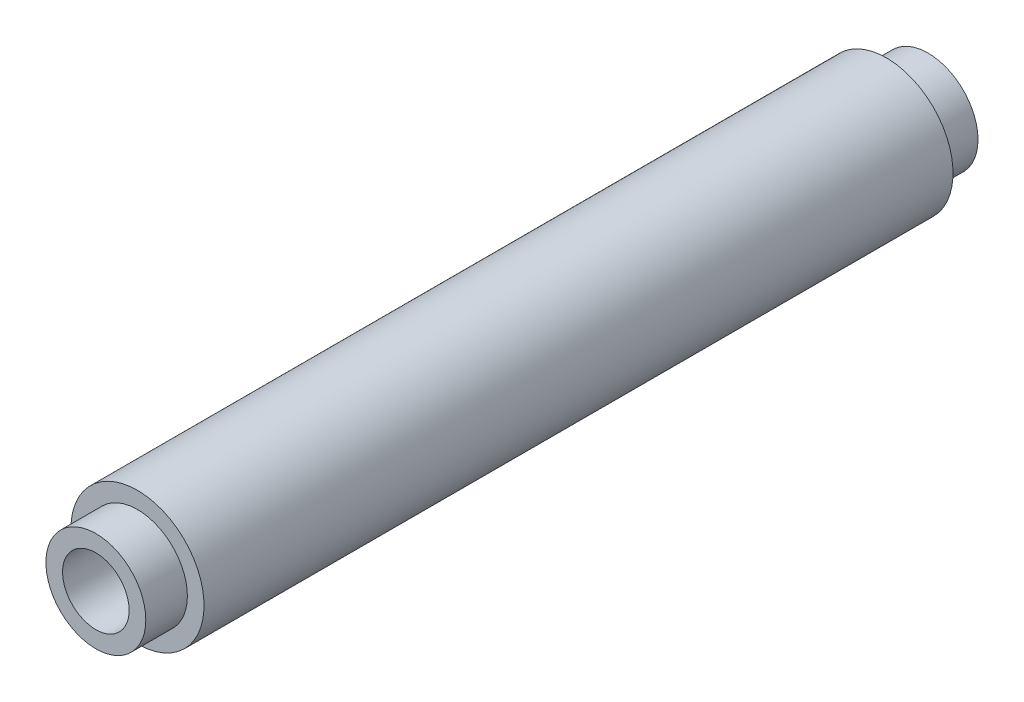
ISO-10303-21;
HEADER;
FILE_DESCRIPTION(('STEP AP214'),'2;1');
FILE_NAME('part.step','',(''),(''),'','','');
FILE_SCHEMA(('AUTOMOTIVE_DESIGN { 1 0 10303 214 1 1 1 1 }'));
ENDSEC;
DATA;
#1=APPLICATION_CONTEXT('core data for automotive mechanical design processes');
#2=APPLICATION_PROTOCOL_DEFINITION('international standard','automotive_design',2000,#1);
#3=PRODUCT_CONTEXT('',#1,'mechanical');
#4=PRODUCT('Part','Part','',(#3));
#5=PRODUCT_RELATED_PRODUCT_CATEGORY('part','',(#4));
#6=PRODUCT_DEFINITION_FORMATION('','',#4);
#7=PRODUCT_DEFINITION_CONTEXT('part definition',#1,'design');
#8=PRODUCT_DEFINITION('design','',#6,#7);
#9=PRODUCT_DEFINITION_SHAPE('','',#8);
#10=(LENGTH_UNIT() NAMED_UNIT(*) SI_UNIT(.MILLI.,.METRE.));
#11=(NAMED_UNIT(*) PLANE_ANGLE_UNIT() SI_UNIT($,.RADIAN.));
#12=(NAMED_UNIT(*) SI_UNIT($,.STERADIAN.) SOLID_ANGLE_UNIT());
#13=UNCERTAINTY_MEASURE_WITH_UNIT(LENGTH_MEASURE(1.E-05),#10,'distance_accuracy_value','');
#14=(GEOMETRIC_REPRESENTATION_CONTEXT(3) GLOBAL_UNCERTAINTY_ASSIGNED_CONTEXT((#13)) GLOBAL_UNIT_ASSIGNED_CONTEXT((#10,
#11,#12)) REPRESENTATION_CONTEXT('',''));
#15=CARTESIAN_POINT('',(0.,0.,0.));
#16=DIRECTION('',(0.,0.,1.));
#17=DIRECTION('',(1.,0.,0.));
#18=AXIS2_PLACEMENT_3D('',#15,#16,#17);
#19=CARTESIAN_POINT('',(0.,0.,90.));
#20=DIRECTION('',(0.,0.,-1.));
#21=DIRECTION('',(-1.,0.,0.));
#22=AXIS2_PLACEMENT_3D('',#19,#20,#21);
#23=CYLINDRICAL_SURFACE('',#22,8.);
#24=CARTESIAN_POINT('',(0.,0.,90.));
#25=DIRECTION('',(0.,0.,1.));
#26=DIRECTION('',(1.,0.,0.));
#27=AXIS2_PLACEMENT_3D('',#24,#25,#26);
#28=CIRCLE('',#27,8.);
#29=CARTESIAN_POINT('',(-8.,0.,90.));
#30=VERTEX_POINT('',#29);
#31=EDGE_CURVE('E44',#30,#30,#28,.T.);
#32=CARTESIAN_POINT('',(0.,0.,0.));
#33=DIRECTION('',(0.,0.,1.));
#34=DIRECTION('',(1.,0.,0.));
#35=AXIS2_PLACEMENT_3D('',#32,#33,#34);
#36=CIRCLE('',#35,8.);
#37=CARTESIAN_POINT('',(-8.,0.,0.));
#38=VERTEX_POINT('',#37);
#39=EDGE_CURVE('E49',#38,#38,#36,.T.);
#40=CARTESIAN_POINT('',(-8.,0.,90.));
#41=CARTESIAN_POINT('',(-8.,0.,89.0625));
#42=CARTESIAN_POINT('',(-8.,0.,88.125));
#43=CARTESIAN_POINT('',(-8.,0.,86.25));
#44=CARTESIAN_POINT('',(-8.,0.,85.3125));
#45=CARTESIAN_POINT('',(-8.,0.,83.4375));
#46=CARTESIAN_POINT('',(-8.,0.,82.5));
#47=CARTESIAN_POINT('',(-8.,0.,80.625));
#48=CARTESIAN_POINT('',(-8.,0.,79.6875));
#49=CARTESIAN_POINT('',(-8.,0.,77.8125));
#50=CARTESIAN_POINT('',(-8.,0.,76.875));
#51=CARTESIAN_POINT('',(-8.,0.,75.));
#52=CARTESIAN_POINT('',(-8.,0.,74.0625));
#53=CARTESIAN_POINT('',(-8.,0.,72.1875));
#54=CARTESIAN_POINT('',(-8.,0.,71.25));
#55=CARTESIAN_POINT('',(-8.,0.,69.375));
#56=CARTESIAN_POINT('',(-8.,0.,68.4375));
#57=CARTESIAN_POINT('',(-8.,0.,66.5625));
#58=CARTESIAN_POINT('',(-8.,0.,65.625));
#59=CARTESIAN_POINT('',(-8.,0.,63.75));
#60=CARTESIAN_POINT('',(-8.,0.,62.8125));
#61=CARTESIAN_POINT('',(-8.,0.,60.9375));
#62=CARTESIAN_POINT('',(-8.,0.,60.));
#63=CARTESIAN_POINT('',(-8.,0.,58.125));
#64=CARTESIAN_POINT('',(-8.,0.,57.1875));
#65=CARTESIAN_POINT('',(-8.,0.,55.3125));
#66=CARTESIAN_POINT('',(-8.,0.,54.375));
#67=CARTESIAN_POINT('',(-8.,0.,52.5));
#68=CARTESIAN_POINT('',(-8.,0.,51.5625));
#69=CARTESIAN_POINT('',(-8.,0.,49.6875));
#70=CARTESIAN_POINT('',(-8.,0.,48.75));
#71=CARTESIAN_POINT('',(-8.,0.,46.875));
#72=CARTESIAN_POINT('',(-8.,0.,45.9375));
#73=CARTESIAN_POINT('',(-8.,0.,44.0625));
#74=CARTESIAN_POINT('',(-8.,0.,43.125));
#75=CARTESIAN_POINT('',(-8.,0.,41.25));
#76=CARTESIAN_POINT('',(-8.,0.,40.3125));
#77=CARTESIAN_POINT('',(-8.,0.,38.4375));
#78=CARTESIAN_POINT('',(-8.,0.,37.5));
#79=CARTESIAN_POINT('',(-8.,0.,35.625));
#80=CARTESIAN_POINT('',(-8.,0.,34.6875));
#81=CARTESIAN_POINT('',(-8.,0.,32.8125));
#82=CARTESIAN_POINT('',(-8.,0.,31.875));
#83=CARTESIAN_POINT('',(-8.,0.,30.));
#84=CARTESIAN_POINT('',(-8.,0.,29.0625));
#85=CARTESIAN_POINT('',(-8.,0.,27.1875));
#86=CARTESIAN_POINT('',(-8.,0.,26.25));
#87=CARTESIAN_POINT('',(-8.,0.,24.375));
#88=CARTESIAN_POINT('',(-8.,0.,23.4375));
#89=CARTESIAN_POINT('',(-8.,0.,21.5625));
#90=CARTESIAN_POINT('',(-8.,0.,20.625));
#91=CARTESIAN_POINT('',(-8.,0.,18.75));
#92=CARTESIAN_POINT('',(-8.,0.,17.8125));
#93=CARTESIAN_POINT('',(-8.,0.,15.9375));
#94=CARTESIAN_POINT('',(-8.,0.,15.));
#95=CARTESIAN_POINT('',(-8.,0.,13.125));
#96=CARTESIAN_POINT('',(-8.,0.,12.1875));
#97=CARTESIAN_POINT('',(-8.,0.,10.3125));
#98=CARTESIAN_POINT('',(-8.,0.,9.37499999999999));
#99=CARTESIAN_POINT('',(-8.,0.,7.49999999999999));
#100=CARTESIAN_POINT('',(-8.,0.,6.56249999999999));
#101=CARTESIAN_POINT('',(-8.,0.,4.68749999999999));
#102=CARTESIAN_POINT('',(-8.,0.,3.74999999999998));
#103=CARTESIAN_POINT('',(-8.,0.,1.87499999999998));
#104=CARTESIAN_POINT('',(-8.,0.,0.937499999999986));
#105=CARTESIAN_POINT('',(-8.,0.,0.));
#106=B_SPLINE_CURVE_WITH_KNOTS('',3,(#40,#41,#42,#43,#44,#45,#46,#47,#48,#49,#50,#51,#52,#53,
#54,#55,#56,#57,#58,#59,#60,#61,#62,#63,#64,#65,#66,#67,#68,#69,#70,#71,#72,#73,#74,#75,#76,#77,
#78,#79,#80,#81,#82,#83,#84,#85,#86,#87,#88,#89,#90,#91,#92,#93,#94,#95,#96,#97,#98,#99,#100,
#101,#102,#103,#104,#105),.UNSPECIFIED.,.F.,.F.,(4,2,2,2,2,2,2,2,2,2,2,2,2,2,2,2,2,2,2,2,2,2,2,
2,2,2,2,2,2,2,2,2,4),(0.,2.8125,5.62499999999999,8.43749999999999,11.25,14.0625,16.875,19.6875,
22.5,25.3125,28.125,30.9375,33.75,36.5625,39.375,42.1875,45.,47.8125,50.625,53.4375,56.25,
59.0625,61.875,64.6875,67.5,70.3125,73.125,75.9375,78.75,81.5625,84.375,87.1875,90.),.UNSPECIFIED.);
#107=EDGE_CURVE('BSEAM37',#30,#38,#106,.T.);
#108=ORIENTED_EDGE('',*,*,#31,.F.);
#109=ORIENTED_EDGE('',*,*,#39,.T.);
#110=ORIENTED_EDGE('',*,*,#107,.T.);
#111=ORIENTED_EDGE('',*,*,#107,.F.);
#112=EDGE_LOOP('',(#108,#110,#109,#111));
#113=FACE_BOUND('',#112,.T.);
#114=ADVANCED_FACE('F37',(#113),#23,.T.);
#115=CARTESIAN_POINT('',(0.,0.,90.));
#116=DIRECTION('',(0.,0.,1.));
#117=DIRECTION('',(1.,0.,0.));
#118=AXIS2_PLACEMENT_3D('',#115,#116,#117);
#119=PLANE('',#118);
#120=CARTESIAN_POINT('',(0.,0.,90.));
#121=DIRECTION('',(0.,0.,1.));
#122=DIRECTION('',(1.,0.,0.));
#123=AXIS2_PLACEMENT_3D('',#120,#121,#122);
#124=CIRCLE('',#123,6.);
#125=CARTESIAN_POINT('',(6.,0.,90.));
#126=VERTEX_POINT('',#125);
#127=EDGE_CURVE('E10',#126,#126,#124,.T.);
#128=ORIENTED_EDGE('',*,*,#127,.F.);
#129=EDGE_LOOP('',(#128));
#130=FACE_BOUND('',#129,.T.);
#131=ORIENTED_EDGE('',*,*,#31,.T.);
#132=EDGE_LOOP('',(#131));
#133=FACE_BOUND('',#132,.T.);
#134=ADVANCED_FACE('F106',(#130,#133),#119,.T.);
#135=CARTESIAN_POINT('',(0.,0.,0.));
#136=DIRECTION('',(0.,0.,1.));
#137=DIRECTION('',(1.,0.,0.));
#138=AXIS2_PLACEMENT_3D('',#135,#136,#137);
#139=PLANE('',#138);
#140=CARTESIAN_POINT('',(0.,0.,0.));
#141=DIRECTION('',(0.,0.,1.));
#142=DIRECTION('',(1.,0.,0.));
#143=AXIS2_PLACEMENT_3D('',#140,#141,#142);
#144=CIRCLE('',#143,6.);
#145=CARTESIAN_POINT('',(6.,0.,0.));
#146=VERTEX_POINT('',#145);
#147=EDGE_CURVE('E40',#146,#146,#144,.T.);
#148=ORIENTED_EDGE('',*,*,#147,.T.);
#149=EDGE_LOOP('',(#148));
#150=FACE_BOUND('',#149,.T.);
#151=ORIENTED_EDGE('',*,*,#39,.F.);
#152=EDGE_LOOP('',(#151));
#153=FACE_BOUND('',#152,.T.);
#154=ADVANCED_FACE('F111',(#150,#153),#139,.F.);
#155=CARTESIAN_POINT('',(0.,0.,-5.));
#156=DIRECTION('',(0.,0.,1.));
#157=DIRECTION('',(1.,0.,0.));
#158=AXIS2_PLACEMENT_3D('',#155,#156,#157);
#159=CYLINDRICAL_SURFACE('',#158,6.);
#160=CARTESIAN_POINT('',(0.,0.,-5.));
#161=DIRECTION('',(0.,0.,1.));
#162=DIRECTION('',(1.,0.,0.));
#163=AXIS2_PLACEMENT_3D('',#160,#161,#162);
#164=CIRCLE('',#163,6.);
#165=CARTESIAN_POINT('',(6.,0.,-5.));
#166=VERTEX_POINT('',#165);
#167=EDGE_CURVE('E52',#166,#166,#164,.T.);
#168=ORIENTED_EDGE('',*,*,#167,.T.);
#169=EDGE_LOOP('',(#168));
#170=FACE_BOUND('',#169,.T.);
#171=ORIENTED_EDGE('',*,*,#147,.F.);
#172=EDGE_LOOP('',(#171));
#173=FACE_BOUND('',#172,.T.);
#174=ADVANCED_FACE('F100',(#170,#173),#159,.T.);
#175=CARTESIAN_POINT('',(0.,0.,-5.));
#176=DIRECTION('',(0.,0.,1.));
#177=DIRECTION('',(1.,0.,0.));
#178=AXIS2_PLACEMENT_3D('',#175,#176,#177);
#179=PLANE('',#178);
#180=CARTESIAN_POINT('',(0.,0.,-5.));
#181=DIRECTION('',(0.,0.,1.));
#182=DIRECTION('',(1.,0.,0.));
#183=AXIS2_PLACEMENT_3D('',#180,#181,#182);
#184=CIRCLE('',#183,4.);
#185=CARTESIAN_POINT('',(4.,0.,-5.));
#186=VERTEX_POINT('',#185);
#187=EDGE_CURVE('E61',#186,#186,#184,.T.);
#188=ORIENTED_EDGE('',*,*,#187,.T.);
#189=EDGE_LOOP('',(#188));
#190=FACE_BOUND('',#189,.T.);
#191=ORIENTED_EDGE('',*,*,#167,.F.);
#192=EDGE_LOOP('',(#191));
#193=FACE_BOUND('',#192,.T.);
#194=ADVANCED_FACE('F103',(#190,#193),#179,.F.);
#195=CARTESIAN_POINT('',(0.,0.,-5.));
#196=DIRECTION('',(0.,0.,1.));
#197=DIRECTION('',(1.,0.,0.));
#198=AXIS2_PLACEMENT_3D('',#195,#196,#197);
#199=CYLINDRICAL_SURFACE('',#198,4.);
#200=ORIENTED_EDGE('',*,*,#187,.F.);
#201=EDGE_LOOP('',(#200));
#202=FACE_BOUND('',#201,.T.);
#203=CARTESIAN_POINT('',(0.,0.,10.));
#204=DIRECTION('',(0.,0.,-1.));
#205=DIRECTION('',(-1.,0.,0.));
#206=AXIS2_PLACEMENT_3D('',#203,#204,#205);
#207=CIRCLE('',#206,4.);
#208=CARTESIAN_POINT('',(-4.,0.,10.));
#209=VERTEX_POINT('',#208);
#210=EDGE_CURVE('E74',#209,#209,#207,.T.);
#211=ORIENTED_EDGE('',*,*,#210,.F.);
#212=EDGE_LOOP('',(#211));
#213=FACE_BOUND('',#212,.T.);
#214=ADVANCED_FACE('F89',(#202,#213),#199,.F.);
#215=ORIENTED_EDGE('',*,*,#127,.T.);
#216=EDGE_LOOP('',(#215));
#217=FACE_BOUND('',#216,.T.);
#218=CARTESIAN_POINT('',(0.,0.,95.));
#219=DIRECTION('',(0.,0.,1.));
#220=DIRECTION('',(1.,0.,0.));
#221=AXIS2_PLACEMENT_3D('',#218,#219,#220);
#222=CIRCLE('',#221,6.);
#223=CARTESIAN_POINT('',(6.,0.,95.));
#224=VERTEX_POINT('',#223);
#225=EDGE_CURVE('E65',#224,#224,#222,.T.);
#226=ORIENTED_EDGE('',*,*,#225,.F.);
#227=EDGE_LOOP('',(#226));
#228=FACE_BOUND('',#227,.T.);
#229=ADVANCED_FACE('F86',(#217,#228),#159,.T.);
#230=CARTESIAN_POINT('',(0.,0.,95.));
#231=DIRECTION('',(0.,0.,1.));
#232=DIRECTION('',(1.,0.,0.));
#233=AXIS2_PLACEMENT_3D('',#230,#231,#232);
#234=CIRCLE('',#233,4.);
#235=CARTESIAN_POINT('',(4.,0.,95.));
#236=VERTEX_POINT('',#235);
#237=EDGE_CURVE('E69',#236,#236,#234,.T.);
#238=ORIENTED_EDGE('',*,*,#237,.T.);
#239=EDGE_LOOP('',(#238));
#240=FACE_BOUND('',#239,.T.);
#241=CARTESIAN_POINT('',(0.,0.,80.));
#242=DIRECTION('',(0.,0.,1.));
#243=DIRECTION('',(1.,0.,0.));
#244=AXIS2_PLACEMENT_3D('',#241,#242,#243);
#245=CIRCLE('',#244,4.);
#246=CARTESIAN_POINT('',(4.,0.,80.));
#247=VERTEX_POINT('',#246);
#248=EDGE_CURVE('E77',#247,#247,#245,.T.);
#249=ORIENTED_EDGE('',*,*,#248,.F.);
#250=EDGE_LOOP('',(#249));
#251=FACE_BOUND('',#250,.T.);
#252=ADVANCED_FACE('F83',(#240,#251),#199,.F.);
#253=CARTESIAN_POINT('',(0.,0.,95.));
#254=DIRECTION('',(0.,0.,1.));
#255=DIRECTION('',(1.,0.,0.));
#256=AXIS2_PLACEMENT_3D('',#253,#254,#255);
#257=PLANE('',#256);
#258=ORIENTED_EDGE('',*,*,#225,.T.);
#259=EDGE_LOOP('',(#258));
#260=FACE_BOUND('',#259,.T.);
#261=ORIENTED_EDGE('',*,*,#237,.F.);
#262=EDGE_LOOP('',(#261));
#263=FACE_BOUND('',#262,.T.);
#264=ADVANCED_FACE('F85',(#260,#263),#257,.T.);
#265=CARTESIAN_POINT('',(0.,0.,10.));
#266=DIRECTION('',(0.,0.,-1.));
#267=DIRECTION('',(-1.,0.,0.));
#268=AXIS2_PLACEMENT_3D('',#265,#266,#267);
#269=PLANE('',#268);
#270=ORIENTED_EDGE('',*,*,#210,.T.);
#271=EDGE_LOOP('',(#270));
#272=FACE_BOUND('',#271,.T.);
#273=ADVANCED_FACE('F95',(#272),#269,.T.);
#274=CARTESIAN_POINT('',(0.,0.,80.));
#275=DIRECTION('',(0.,0.,1.));
#276=DIRECTION('',(1.,0.,0.));
#277=AXIS2_PLACEMENT_3D('',#274,#275,#276);
#278=PLANE('',#277);
#279=ORIENTED_EDGE('',*,*,#248,.T.);
#280=EDGE_LOOP('',(#279));
#281=FACE_BOUND('',#280,.T.);
#282=ADVANCED_FACE('F81',(#281),#278,.T.);
#283=CLOSED_SHELL('',(#114,#134,#154,#174,#194,#214,#229,#252,#264,#273,#282));
#284=MANIFOLD_SOLID_BREP('B2',#283);
#285=ADVANCED_BREP_SHAPE_REPRESENTATION('',(#18,#284),#14);
#286=SHAPE_DEFINITION_REPRESENTATION(#9,#285);
ENDSEC;
END-ISO-10303-21;
